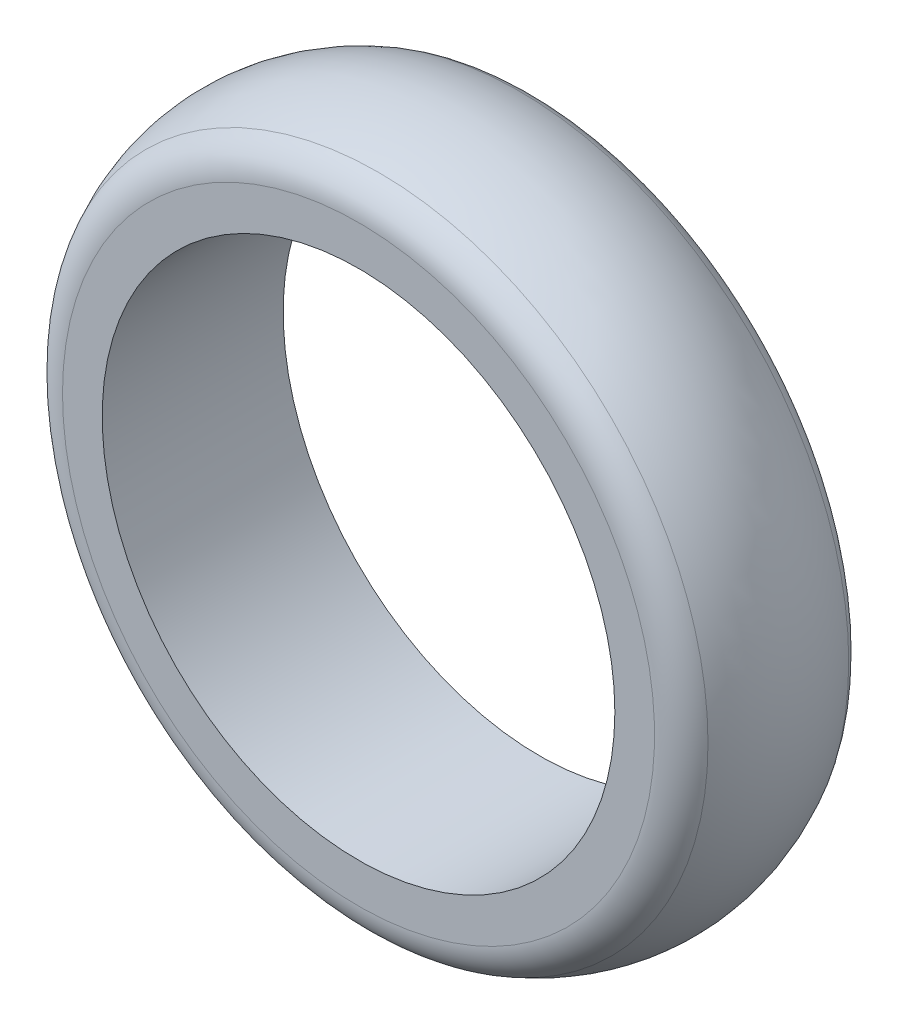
from build123d import *

# Parameters (mm, degrees)
REDONDEO1_R = 5


with BuildPart() as part:
    # Croquis1 → Revoluci_n1 (revolve)
    with BuildSketch(Plane(origin=(0, 0, 0), x_dir=(0, 0, -1), z_dir=(1, 0, 0)), mode=Mode.PRIVATE) as revoluci_n1_sk:
        with BuildLine():
            Line((0, 34), (24, 34))
            Line((24, 34), (24, 42))
            ThreePointArc((24, 42), (12, 46), (0, 42))
            Line((0, 42), (0, 34))
        make_face()
    revolve(revoluci_n1_sk.sketch.rotate(Axis((0, 0, 0), (0, 0, -1)), 90), axis=Axis((0, 0, 0), (0, 0, -1)))

    # Redondeo1
    redondeo1_edges = [part.edges().sort_by_distance(p)[0] for p in [
        (-42, 0, -24),
        (-42, 0, 0),
    ]]
    fillet(redondeo1_edges, radius=REDONDEO1_R)


solid = part.part
